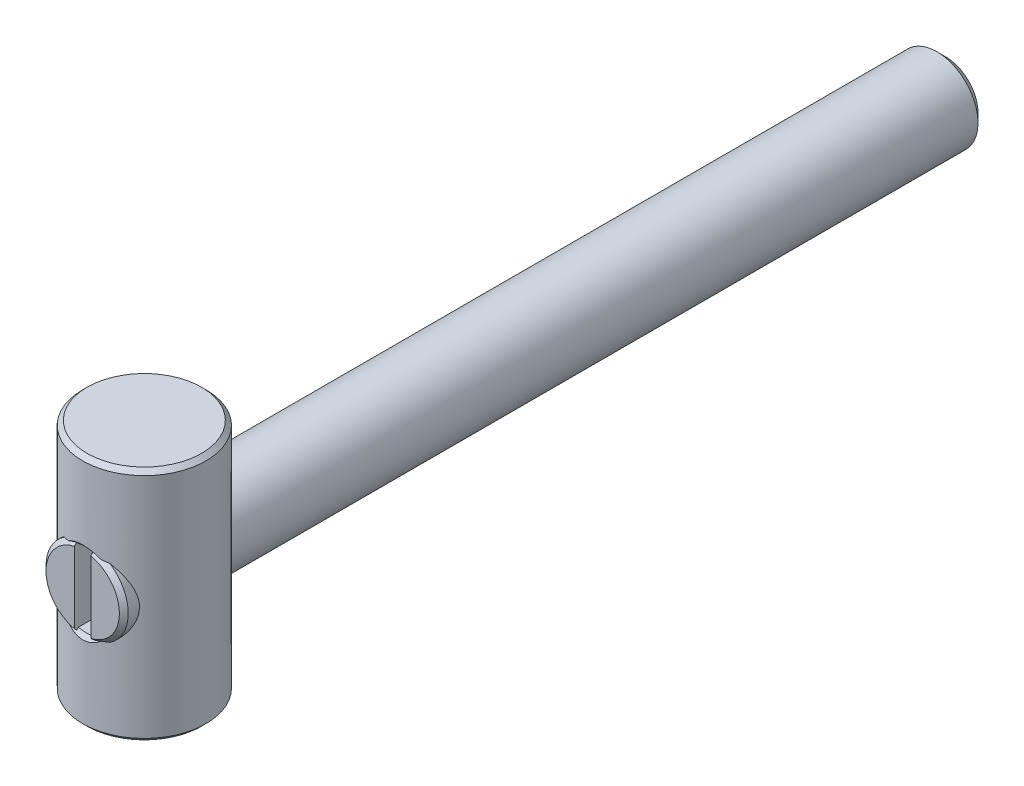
ISO-10303-21;
HEADER;
FILE_DESCRIPTION(('STEP AP214'),'2;1');
FILE_NAME('part.step','',(''),(''),'','','');
FILE_SCHEMA(('AUTOMOTIVE_DESIGN { 1 0 10303 214 1 1 1 1 }'));
ENDSEC;
DATA;
#1=APPLICATION_CONTEXT('core data for automotive mechanical design processes');
#2=APPLICATION_PROTOCOL_DEFINITION('international standard','automotive_design',2000,#1);
#3=PRODUCT_CONTEXT('',#1,'mechanical');
#4=PRODUCT('Part','Part','',(#3));
#5=PRODUCT_RELATED_PRODUCT_CATEGORY('part','',(#4));
#6=PRODUCT_DEFINITION_FORMATION('','',#4);
#7=PRODUCT_DEFINITION_CONTEXT('part definition',#1,'design');
#8=PRODUCT_DEFINITION('design','',#6,#7);
#9=PRODUCT_DEFINITION_SHAPE('','',#8);
#10=(LENGTH_UNIT() NAMED_UNIT(*) SI_UNIT(.MILLI.,.METRE.));
#11=(NAMED_UNIT(*) PLANE_ANGLE_UNIT() SI_UNIT($,.RADIAN.));
#12=(NAMED_UNIT(*) SI_UNIT($,.STERADIAN.) SOLID_ANGLE_UNIT());
#13=UNCERTAINTY_MEASURE_WITH_UNIT(LENGTH_MEASURE(1.E-05),#10,'distance_accuracy_value','');
#14=(GEOMETRIC_REPRESENTATION_CONTEXT(3) GLOBAL_UNCERTAINTY_ASSIGNED_CONTEXT((#13)) GLOBAL_UNIT_ASSIGNED_CONTEXT((#10,
#11,#12)) REPRESENTATION_CONTEXT('',''));
#15=CARTESIAN_POINT('',(0.,0.,0.));
#16=DIRECTION('',(0.,0.,1.));
#17=DIRECTION('',(1.,0.,0.));
#18=AXIS2_PLACEMENT_3D('',#15,#16,#17);
#19=CARTESIAN_POINT('',(0.,0.,-4.));
#20=DIRECTION('',(0.,0.,-1.));
#21=DIRECTION('',(-1.,0.,0.));
#22=AXIS2_PLACEMENT_3D('',#19,#20,#21);
#23=CYLINDRICAL_SURFACE('',#22,2.);
#24=CARTESIAN_POINT('',(1.11399719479,1.6610268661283,2.7855));
#25=CARTESIAN_POINT('',(1.16352046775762,1.62780404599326,2.76569630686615));
#26=CARTESIAN_POINT('',(1.21129322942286,1.59256213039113,2.74505589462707));
#27=CARTESIAN_POINT('',(1.30320814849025,1.51827100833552,2.70263011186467));
#28=CARTESIAN_POINT('',(1.34735150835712,1.47922307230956,2.68084512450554));
#29=CARTESIAN_POINT('',(1.47484746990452,1.35604681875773,2.61420147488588));
#30=CARTESIAN_POINT('',(1.55249324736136,1.26640812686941,2.56837763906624));
#31=CARTESIAN_POINT('',(1.69127884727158,1.07409237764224,2.47919034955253));
#32=CARTESIAN_POINT('',(1.75241552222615,0.971412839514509,2.43582736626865));
#33=CARTESIAN_POINT('',(1.85615019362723,0.754349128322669,2.35773638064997));
#34=CARTESIAN_POINT('',(1.89882852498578,0.640018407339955,2.32297124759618));
#35=CARTESIAN_POINT('',(1.95314493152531,0.438747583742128,2.27729599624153));
#36=CARTESIAN_POINT('',(1.97029467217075,0.354216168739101,2.26233654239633));
#37=CARTESIAN_POINT('',(1.99352675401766,0.182551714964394,2.24189698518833));
#38=CARTESIAN_POINT('',(1.99962325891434,0.0954221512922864,2.23640475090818));
#39=CARTESIAN_POINT('',(2.00034328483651,-0.079061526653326,2.23576112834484));
#40=CARTESIAN_POINT('',(1.99494860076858,-0.166415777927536,2.24062614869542));
#41=CARTESIAN_POINT('',(1.97303463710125,-0.338667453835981,2.25994148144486));
#42=CARTESIAN_POINT('',(1.95650152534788,-0.423561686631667,2.27440371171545));
#43=CARTESIAN_POINT('',(1.90813577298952,-0.608419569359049,2.31521704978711));
#44=CARTESIAN_POINT('',(1.87361856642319,-0.707228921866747,2.34356486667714));
#45=CARTESIAN_POINT('',(1.79082971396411,-0.8964602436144,2.40741595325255));
#46=CARTESIAN_POINT('',(1.7425316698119,-0.986865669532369,2.44293291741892));
#47=CARTESIAN_POINT('',(1.63252243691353,-1.15999565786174,2.51781416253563));
#48=CARTESIAN_POINT('',(1.57057489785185,-1.2425426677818,2.55723849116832));
#49=CARTESIAN_POINT('',(1.43480463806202,-1.39709631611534,2.63580434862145));
#50=CARTESIAN_POINT('',(1.36100810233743,-1.46912554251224,2.67494630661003));
#51=CARTESIAN_POINT('',(1.25497641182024,-1.55764120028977,2.72505273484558));
#52=CARTESIAN_POINT('',(1.22762940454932,-1.57928737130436,2.73749131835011));
#53=CARTESIAN_POINT('',(1.17172197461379,-1.62119899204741,2.76188255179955));
#54=CARTESIAN_POINT('',(1.14316238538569,-1.64146536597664,2.77383552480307));
#55=CARTESIAN_POINT('',(1.11399719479,-1.6610268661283,2.7855));
#56=B_SPLINE_CURVE_WITH_KNOTS('',3,(#24,#25,#26,#27,#28,#29,#30,#31,#32,#33,#34,#35,#36,#37,#38,
#39,#40,#41,#42,#43,#44,#45,#46,#47,#48,#49,#50,#51,#52,#53,#54,#55),.UNSPECIFIED.,.F.,.F.,(4,2,
2,2,2,2,2,2,2,2,2,2,2,2,2,4),(0.,0.188362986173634,0.376663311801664,0.756187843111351,
1.135784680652,1.51371238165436,1.77524600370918,2.03644425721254,2.29805662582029,
2.55999447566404,2.88356492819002,3.20775941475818,3.5380838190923,3.86768804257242,
3.97873730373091,4.08971143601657),.UNSPECIFIED.);
#57=CARTESIAN_POINT('',(1.11399719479,1.6610268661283,2.7855));
#58=VERTEX_POINT('',#57);
#59=CARTESIAN_POINT('',(1.11399719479,-1.6610268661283,2.7855));
#60=VERTEX_POINT('',#59);
#61=EDGE_CURVE('E230',#58,#60,#56,.T.);
#62=ORIENTED_EDGE('',*,*,#61,.F.);
#63=CARTESIAN_POINT('',(0.,0.,2.7855));
#64=DIRECTION('',(0.,0.,-1.));
#65=DIRECTION('',(-1.,0.,0.));
#66=AXIS2_PLACEMENT_3D('',#63,#64,#65);
#67=CIRCLE('',#66,2.);
#68=EDGE_CURVE('E125',#58,#60,#67,.T.);
#69=ORIENTED_EDGE('',*,*,#68,.T.);
#70=EDGE_LOOP('',(#62,#69));
#71=FACE_BOUND('',#70,.T.);
#72=ADVANCED_FACE('F14',(#71),#23,.T.);
#73=CARTESIAN_POINT('',(0.,0.,3.));
#74=DIRECTION('',(0.,0.,-1.));
#75=DIRECTION('',(-1.,0.,0.));
#76=AXIS2_PLACEMENT_3D('',#73,#74,#75);
#77=PLANE('',#76);
#78=DIRECTION('',(0.,-1.,0.));
#79=VECTOR('',#78,1.);
#80=CARTESIAN_POINT('',(-0.4,0.,3.));
#81=LINE('',#80,#79);
#82=CARTESIAN_POINT('',(-0.4,1.74011788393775,3.));
#83=VERTEX_POINT('',#82);
#84=CARTESIAN_POINT('',(-0.4,-1.74011788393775,3.));
#85=VERTEX_POINT('',#84);
#86=EDGE_CURVE('E110',#83,#85,#81,.T.);
#87=ORIENTED_EDGE('',*,*,#86,.F.);
#88=CARTESIAN_POINT('',(0.,0.,3.));
#89=DIRECTION('',(0.,0.,-1.));
#90=DIRECTION('',(-1.,0.,0.));
#91=AXIS2_PLACEMENT_3D('',#88,#89,#90);
#92=CIRCLE('',#91,1.7855);
#93=EDGE_CURVE('E121',#85,#83,#92,.T.);
#94=ORIENTED_EDGE('',*,*,#93,.F.);
#95=EDGE_LOOP('',(#87,#94));
#96=FACE_BOUND('',#95,.T.);
#97=ADVANCED_FACE('F120',(#96),#77,.F.);
#98=CARTESIAN_POINT('',(0.,0.,3.));
#99=DIRECTION('',(0.,0.,-1.));
#100=DIRECTION('',(-1.,0.,0.));
#101=AXIS2_PLACEMENT_3D('',#98,#99,#100);
#102=CONICAL_SURFACE('',#101,1.7855,0.785398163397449);
#103=CARTESIAN_POINT('',(-1.16667612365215,1.65104074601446,2.76385));
#104=CARTESIAN_POINT('',(-1.09329916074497,1.66504476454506,2.79481750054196));
#105=CARTESIAN_POINT('',(-1.01868995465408,1.67914160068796,2.82287437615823));
#106=CARTESIAN_POINT('',(-0.86782079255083,1.70596914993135,2.87283254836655));
#107=CARTESIAN_POINT('',(-0.791576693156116,1.7187090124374,2.89477692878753));
#108=CARTESIAN_POINT('',(-0.637125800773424,1.74152361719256,2.93264181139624));
#109=CARTESIAN_POINT('',(-0.558917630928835,1.75159642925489,2.94855795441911));
#110=CARTESIAN_POINT('',(-0.440293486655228,1.76402293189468,2.96778774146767));
#111=CARTESIAN_POINT('',(-0.400383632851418,1.76772662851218,2.97343575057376));
#112=CARTESIAN_POINT('',(-0.320283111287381,1.77413676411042,2.98312696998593));
#113=CARTESIAN_POINT('',(-0.280092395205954,1.77684302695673,2.98716989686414));
#114=CARTESIAN_POINT('',(-0.2398,1.77901031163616,2.99040063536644));
#115=B_SPLINE_CURVE_WITH_KNOTS('',3,(#103,#104,#105,#106,#107,#108,#109,#110,#111,#112,#113,
#114),.UNSPECIFIED.,.F.,.F.,(4,2,2,2,2,4),(0.,0.242566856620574,0.483378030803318,
0.724363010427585,0.845755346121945,0.967169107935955),.UNSPECIFIED.);
#116=CARTESIAN_POINT('',(-1.11399719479,1.6610268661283,2.7855));
#117=VERTEX_POINT('',#116);
#118=CARTESIAN_POINT('',(-0.794982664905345,1.71770344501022,2.89275));
#119=VERTEX_POINT('',#118);
#120=EDGE_CURVE('E9',#117,#119,#115,.T.);
#121=ORIENTED_EDGE('',*,*,#120,.F.);
#122=CARTESIAN_POINT('',(-1.11399719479,-1.6610268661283,2.7855));
#123=VERTEX_POINT('',#122);
#124=EDGE_CURVE('E130',#123,#117,#67,.T.);
#125=ORIENTED_EDGE('',*,*,#124,.F.);
#126=CARTESIAN_POINT('',(-0.2398,-1.77901031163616,2.99040063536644));
#127=CARTESIAN_POINT('',(-0.280092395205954,-1.77684302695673,2.98716989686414));
#128=CARTESIAN_POINT('',(-0.320283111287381,-1.77413676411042,2.98312696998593));
#129=CARTESIAN_POINT('',(-0.400383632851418,-1.76772662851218,2.97343575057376));
#130=CARTESIAN_POINT('',(-0.440293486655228,-1.76402293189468,2.96778774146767));
#131=CARTESIAN_POINT('',(-0.558917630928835,-1.75159642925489,2.94855795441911));
#132=CARTESIAN_POINT('',(-0.637125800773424,-1.74152361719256,2.93264181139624));
#133=CARTESIAN_POINT('',(-0.791576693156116,-1.7187090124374,2.89477692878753));
#134=CARTESIAN_POINT('',(-0.86782079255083,-1.70596914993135,2.87283254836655));
#135=CARTESIAN_POINT('',(-1.01868995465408,-1.67914160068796,2.82287437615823));
#136=CARTESIAN_POINT('',(-1.09329916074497,-1.66504476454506,2.79481750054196));
#137=CARTESIAN_POINT('',(-1.16667612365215,-1.65104074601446,2.76385));
#138=B_SPLINE_CURVE_WITH_KNOTS('',3,(#126,#127,#128,#129,#130,#131,#132,#133,#134,#135,#136,
#137),.UNSPECIFIED.,.F.,.F.,(4,2,2,2,2,4),(0.,0.12141376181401,0.24280609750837,
0.483791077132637,0.724602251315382,0.967169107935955),.UNSPECIFIED.);
#139=CARTESIAN_POINT('',(-0.794982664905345,-1.71770344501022,2.89275));
#140=VERTEX_POINT('',#139);
#141=EDGE_CURVE('E40',#140,#123,#138,.T.);
#142=ORIENTED_EDGE('',*,*,#141,.F.);
#143=CARTESIAN_POINT('',(0.,0.,2.89275));
#144=DIRECTION('',(0.,0.,1.));
#145=DIRECTION('',(1.,0.,0.));
#146=AXIS2_PLACEMENT_3D('',#143,#144,#145);
#147=CIRCLE('',#146,1.89275);
#148=CARTESIAN_POINT('',(-0.4,-1.85000069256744,2.89275));
#149=VERTEX_POINT('',#148);
#150=EDGE_CURVE('E196',#140,#149,#147,.T.);
#151=ORIENTED_EDGE('',*,*,#150,.T.);
#152=CARTESIAN_POINT('',(-0.4,1.96030622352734,2.7848));
#153=CARTESIAN_POINT('',(-0.4,1.91220040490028,2.83193265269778));
#154=CARTESIAN_POINT('',(-0.4,1.86406179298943,2.87903187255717));
#155=CARTESIAN_POINT('',(-0.4,1.76762008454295,2.97321655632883));
#156=CARTESIAN_POINT('',(-0.4,1.71931684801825,3.02030187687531));
#157=CARTESIAN_POINT('',(-0.4,1.6212885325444,3.11563710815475));
#158=CARTESIAN_POINT('',(-0.4,1.5715604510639,3.16388393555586));
#159=CARTESIAN_POINT('',(-0.4,1.47203148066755,3.26014103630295));
#160=CARTESIAN_POINT('',(-0.4,1.42223083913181,3.30815156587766));
#161=CARTESIAN_POINT('',(-0.4,1.27910635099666,3.44557059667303));
#162=CARTESIAN_POINT('',(-0.4,1.18553880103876,3.53472711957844));
#163=CARTESIAN_POINT('',(-0.4,1.04389226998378,3.66771074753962));
#164=CARTESIAN_POINT('',(-0.4,0.996302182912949,3.71205806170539));
#165=CARTESIAN_POINT('',(-0.4,0.900663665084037,3.80018516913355));
#166=CARTESIAN_POINT('',(-0.4,0.852615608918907,3.84396536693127));
#167=CARTESIAN_POINT('',(-0.4,0.757010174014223,3.9295656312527));
#168=CARTESIAN_POINT('',(-0.4,0.709472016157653,3.97140714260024));
#169=CARTESIAN_POINT('',(-0.4,0.613103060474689,4.05388760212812));
#170=CARTESIAN_POINT('',(-0.4,0.564268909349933,4.0945227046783));
#171=CARTESIAN_POINT('',(-0.4,0.489794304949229,4.15330063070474));
#172=CARTESIAN_POINT('',(-0.4,0.464926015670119,4.17241703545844));
#173=CARTESIAN_POINT('',(-0.4,0.414504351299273,4.2097188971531));
#174=CARTESIAN_POINT('',(-0.4,0.388951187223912,4.22790463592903));
#175=CARTESIAN_POINT('',(-0.4,0.337021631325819,4.26280071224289));
#176=CARTESIAN_POINT('',(-0.4,0.310649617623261,4.27951751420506));
#177=CARTESIAN_POINT('',(-0.4,0.25664656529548,4.31075573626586));
#178=CARTESIAN_POINT('',(-0.4,0.229017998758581,4.32528124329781));
#179=CARTESIAN_POINT('',(-0.4,0.194529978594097,4.34073824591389));
#180=CARTESIAN_POINT('',(-0.4,0.188431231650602,4.34337414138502));
#181=CARTESIAN_POINT('',(-0.4,0.176155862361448,4.34846503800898));
#182=CARTESIAN_POINT('',(-0.4,0.169979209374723,4.35091996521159));
#183=CARTESIAN_POINT('',(-0.4,0.151336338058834,4.35798334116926));
#184=CARTESIAN_POINT('',(-0.4,0.138753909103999,4.36229188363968));
#185=CARTESIAN_POINT('',(-0.4,0.113503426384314,4.36987933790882));
#186=CARTESIAN_POINT('',(-0.4,0.100840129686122,4.37317392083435));
#187=CARTESIAN_POINT('',(-0.4,0.0752707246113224,4.37867100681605));
#188=CARTESIAN_POINT('',(-0.4,0.0623645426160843,4.38087317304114));
#189=CARTESIAN_POINT('',(-0.4,0.0361451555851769,4.38408457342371));
#190=CARTESIAN_POINT('',(-0.4,0.0228289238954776,4.38506967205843));
#191=CARTESIAN_POINT('',(-0.4,-0.00382941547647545,4.38570474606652));
#192=CARTESIAN_POINT('',(-0.4,-0.0171715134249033,4.38535515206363));
#193=CARTESIAN_POINT('',(-0.4,-0.0570913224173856,4.38231129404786));
#194=CARTESIAN_POINT('',(-0.4,-0.0835282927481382,4.37761777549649));
#195=CARTESIAN_POINT('',(-0.4,-0.144402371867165,4.36159805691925));
#196=CARTESIAN_POINT('',(-0.4,-0.178344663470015,4.34850779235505));
#197=CARTESIAN_POINT('',(-0.4,-0.227667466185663,4.32547752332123));
#198=CARTESIAN_POINT('',(-0.4,-0.243900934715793,4.31719757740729));
#199=CARTESIAN_POINT('',(-0.4,-0.275892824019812,4.29976597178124));
#200=CARTESIAN_POINT('',(-0.4,-0.291651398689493,4.29061459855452));
#201=CARTESIAN_POINT('',(-0.4,-0.342427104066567,4.25969743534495));
#202=CARTESIAN_POINT('',(-0.4,-0.376624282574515,4.23660064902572));
#203=CARTESIAN_POINT('',(-0.4,-0.443707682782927,4.18856142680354));
#204=CARTESIAN_POINT('',(-0.4,-0.476592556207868,4.16361716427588));
#205=CARTESIAN_POINT('',(-0.4,-0.541555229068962,4.11253731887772));
#206=CARTESIAN_POINT('',(-0.4,-0.573630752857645,4.08639885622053));
#207=CARTESIAN_POINT('',(-0.4,-0.637167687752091,4.03338342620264));
#208=CARTESIAN_POINT('',(-0.4,-0.668629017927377,4.00650636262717));
#209=CARTESIAN_POINT('',(-0.4,-0.762581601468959,3.92494921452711));
#210=CARTESIAN_POINT('',(-0.4,-0.824422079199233,3.86952173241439));
#211=CARTESIAN_POINT('',(-0.4,-0.947059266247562,3.75773288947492));
#212=CARTESIAN_POINT('',(-0.4,-1.00785750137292,3.70137318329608));
#213=CARTESIAN_POINT('',(-0.4,-1.14419995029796,3.57369126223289));
#214=CARTESIAN_POINT('',(-0.4,-1.21957997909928,3.50219383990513));
#215=CARTESIAN_POINT('',(-0.4,-1.36985690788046,3.35860627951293));
#216=CARTESIAN_POINT('',(-0.4,-1.44475349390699,3.28651581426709));
#217=CARTESIAN_POINT('',(-0.4,-1.59323885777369,3.1429244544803));
#218=CARTESIAN_POINT('',(-0.4,-1.66683198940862,3.07142805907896));
#219=CARTESIAN_POINT('',(-0.4,-1.81374089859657,2.92824339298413));
#220=CARTESIAN_POINT('',(-0.4,-1.88705682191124,2.85655527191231));
#221=CARTESIAN_POINT('',(-0.4,-1.96030622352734,2.7848));
#222=B_SPLINE_CURVE_WITH_KNOTS('',3,(#152,#153,#154,#155,#156,#157,#158,#159,#160,#161,#162,
#163,#164,#165,#166,#167,#168,#169,#170,#171,#172,#173,#174,#175,#176,#177,#178,#179,#180,#181,
#182,#183,#184,#185,#186,#187,#188,#189,#190,#191,#192,#193,#194,#195,#196,#197,#198,#199,#200,
#201,#202,#203,#204,#205,#206,#207,#208,#209,#210,#211,#212,#213,#214,#215,#216,#217,#218,#219,
#220,#221),.UNSPECIFIED.,.F.,.F.,(4,2,2,2,2,2,2,2,2,2,2,2,2,2,2,2,2,2,2,2,2,2,2,2,2,2,2,2,2,2,2,
2,2,2,4),(0.,0.202041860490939,0.404407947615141,0.612267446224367,0.819791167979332,
1.20751042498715,1.40265824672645,1.59765821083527,1.78763722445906,1.97816800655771,
2.07225481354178,2.16631295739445,2.25993394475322,2.35337810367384,2.37330754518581,
2.39324508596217,2.43310931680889,2.47232228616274,2.51154733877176,2.5515383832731,
2.59151652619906,2.67157438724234,2.78007616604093,2.83473709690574,2.88938011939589,
3.0130530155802,3.13684986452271,3.26096287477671,3.38509213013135,3.63419872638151,
3.88290259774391,4.19457948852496,4.50644172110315,4.8142545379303,5.12187303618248),.UNSPECIFIED.);
#223=EDGE_CURVE('E117',#85,#149,#222,.T.);
#224=ORIENTED_EDGE('',*,*,#223,.F.);
#225=ORIENTED_EDGE('',*,*,#93,.T.);
#226=CARTESIAN_POINT('',(-0.4,1.85000069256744,2.89275));
#227=VERTEX_POINT('',#226);
#228=EDGE_CURVE('E106',#227,#83,#222,.T.);
#229=ORIENTED_EDGE('',*,*,#228,.F.);
#230=CARTESIAN_POINT('',(0.,0.,2.89275));
#231=DIRECTION('',(0.,0.,1.));
#232=DIRECTION('',(1.,0.,0.));
#233=AXIS2_PLACEMENT_3D('',#230,#231,#232);
#234=CIRCLE('',#233,1.89275);
#235=EDGE_CURVE('E28',#227,#119,#234,.T.);
#236=ORIENTED_EDGE('',*,*,#235,.T.);
#237=EDGE_LOOP('',(#121,#125,#142,#151,#224,#225,#229,#236));
#238=FACE_BOUND('',#237,.T.);
#239=ADVANCED_FACE('F123',(#238),#102,.T.);
#240=CARTESIAN_POINT('',(0.4,0.,33.));
#241=DIRECTION('',(-1.,0.,0.));
#242=DIRECTION('',(0.,-1.,0.));
#243=AXIS2_PLACEMENT_3D('',#240,#241,#242);
#244=CYLINDRICAL_SURFACE('',#243,31.5);
#245=CARTESIAN_POINT('',(0.4,-1.76576053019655,1.54952957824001));
#246=CARTESIAN_POINT('',(0.349977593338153,-1.77709824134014,1.55016706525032));
#247=CARTESIAN_POINT('',(0.299469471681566,-1.78629930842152,1.55068890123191));
#248=CARTESIAN_POINT('',(0.197847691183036,-1.80038671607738,1.55149171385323));
#249=CARTESIAN_POINT('',(0.146733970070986,-1.8052726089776,1.55177266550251));
#250=CARTESIAN_POINT('',(0.0452193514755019,-1.81063609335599,1.55208115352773));
#251=CARTESIAN_POINT('',(-0.00517737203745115,-1.81119308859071,1.55211325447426));
#252=CARTESIAN_POINT('',(-0.105833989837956,-1.80810483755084,1.55193550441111));
#253=CARTESIAN_POINT('',(-0.156093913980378,-1.8044605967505,1.55172571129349));
#254=CARTESIAN_POINT('',(-0.238696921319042,-1.79499603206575,1.5511843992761));
#255=CARTESIAN_POINT('',(-0.271182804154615,-1.7903758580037,1.55092073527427));
#256=CARTESIAN_POINT('',(-0.335843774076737,-1.77938039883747,1.55029676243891));
#257=CARTESIAN_POINT('',(-0.368018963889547,-1.77300571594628,1.5499364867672));
#258=CARTESIAN_POINT('',(-0.4,-1.76576053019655,1.54952957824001));
#259=B_SPLINE_CURVE_WITH_KNOTS('',3,(#245,#246,#247,#248,#249,#250,#251,#252,#253,#254,#255,
#256,#257,#258),.UNSPECIFIED.,.F.,.F.,(4,2,2,2,2,2,4),(0.,0.153839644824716,0.307695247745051,
0.458721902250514,0.609712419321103,0.708108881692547,0.806471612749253),.UNSPECIFIED.);
#260=CARTESIAN_POINT('',(0.4,-1.76576053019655,1.54952957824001));
#261=VERTEX_POINT('',#260);
#262=CARTESIAN_POINT('',(-0.4,-1.76576053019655,1.54952957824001));
#263=VERTEX_POINT('',#262);
#264=EDGE_CURVE('E345',#261,#263,#259,.T.);
#265=ORIENTED_EDGE('',*,*,#264,.F.);
#266=CARTESIAN_POINT('',(0.4,0.,33.));
#267=DIRECTION('',(1.,0.,0.));
#268=DIRECTION('',(0.,1.,0.));
#269=AXIS2_PLACEMENT_3D('',#266,#267,#268);
#270=CIRCLE('',#269,31.5);
#271=CARTESIAN_POINT('',(0.4,1.76576053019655,1.54952957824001));
#272=VERTEX_POINT('',#271);
#273=EDGE_CURVE('E115',#261,#272,#270,.T.);
#274=ORIENTED_EDGE('',*,*,#273,.T.);
#275=CARTESIAN_POINT('',(-0.4,1.76576053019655,1.54952957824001));
#276=CARTESIAN_POINT('',(-0.349977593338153,1.77709824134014,1.55016706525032));
#277=CARTESIAN_POINT('',(-0.299469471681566,1.78629930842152,1.55068890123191));
#278=CARTESIAN_POINT('',(-0.197847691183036,1.80038671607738,1.55149171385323));
#279=CARTESIAN_POINT('',(-0.146733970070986,1.8052726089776,1.55177266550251));
#280=CARTESIAN_POINT('',(-0.0452193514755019,1.81063609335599,1.55208115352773));
#281=CARTESIAN_POINT('',(0.00517737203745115,1.81119308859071,1.55211325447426));
#282=CARTESIAN_POINT('',(0.105833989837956,1.80810483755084,1.55193550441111));
#283=CARTESIAN_POINT('',(0.156093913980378,1.8044605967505,1.55172571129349));
#284=CARTESIAN_POINT('',(0.238696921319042,1.79499603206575,1.5511843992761));
#285=CARTESIAN_POINT('',(0.271182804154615,1.7903758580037,1.55092073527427));
#286=CARTESIAN_POINT('',(0.335843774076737,1.77938039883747,1.55029676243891));
#287=CARTESIAN_POINT('',(0.368018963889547,1.77300571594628,1.5499364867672));
#288=CARTESIAN_POINT('',(0.4,1.76576053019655,1.54952957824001));
#289=B_SPLINE_CURVE_WITH_KNOTS('',3,(#275,#276,#277,#278,#279,#280,#281,#282,#283,#284,#285,
#286,#287,#288),.UNSPECIFIED.,.F.,.F.,(4,2,2,2,2,2,4),(0.,0.153839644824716,0.307695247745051,
0.458721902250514,0.609712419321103,0.708108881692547,0.806471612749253),.UNSPECIFIED.);
#290=CARTESIAN_POINT('',(-0.4,1.76576053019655,1.54952957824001));
#291=VERTEX_POINT('',#290);
#292=EDGE_CURVE('E194',#291,#272,#289,.T.);
#293=ORIENTED_EDGE('',*,*,#292,.F.);
#294=CARTESIAN_POINT('',(-0.4,0.,33.));
#295=DIRECTION('',(1.,0.,0.));
#296=DIRECTION('',(0.,1.,0.));
#297=AXIS2_PLACEMENT_3D('',#294,#295,#296);
#298=CIRCLE('',#297,31.5);
#299=EDGE_CURVE('E291',#263,#291,#298,.T.);
#300=ORIENTED_EDGE('',*,*,#299,.F.);
#301=EDGE_LOOP('',(#265,#274,#293,#300));
#302=FACE_BOUND('',#301,.T.);
#303=ADVANCED_FACE('F279',(#302),#244,.F.);
#304=CARTESIAN_POINT('',(-0.4,0.,33.));
#305=DIRECTION('',(1.,0.,0.));
#306=DIRECTION('',(0.,1.,0.));
#307=AXIS2_PLACEMENT_3D('',#304,#305,#306);
#308=PLANE('',#307);
#309=CARTESIAN_POINT('',(-0.4,-1.02034635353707,2.09595012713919));
#310=CARTESIAN_POINT('',(-0.4,-1.05950736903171,2.13241722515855));
#311=CARTESIAN_POINT('',(-0.4,-1.09853653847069,2.16902508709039));
#312=CARTESIAN_POINT('',(-0.4,-1.17638543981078,2.24246200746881));
#313=CARTESIAN_POINT('',(-0.4,-1.21520517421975,2.2792910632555));
#314=CARTESIAN_POINT('',(-0.4,-1.33143077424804,2.39001871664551));
#315=CARTESIAN_POINT('',(-0.4,-1.40860528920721,2.46415991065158));
#316=CARTESIAN_POINT('',(-0.4,-1.56257008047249,2.6128326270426));
#317=CARTESIAN_POINT('',(-0.4,-1.6393603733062,2.6873641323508));
#318=CARTESIAN_POINT('',(-0.4,-1.79268710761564,2.83668891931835));
#319=CARTESIAN_POINT('',(-0.4,-1.86922354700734,2.91148220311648));
#320=CARTESIAN_POINT('',(-0.4,-2.0533689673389,3.0918524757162));
#321=CARTESIAN_POINT('',(-0.4,-2.16089223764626,3.19751690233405));
#322=CARTESIAN_POINT('',(-0.4,-2.37571065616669,3.40908334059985));
#323=CARTESIAN_POINT('',(-0.4,-2.48300579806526,3.51498535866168));
#324=CARTESIAN_POINT('',(-0.4,-2.59024265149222,3.62094582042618));
#325=B_SPLINE_CURVE_WITH_KNOTS('',3,(#309,#310,#311,#312,#313,#314,#315,#316,#317,#318,#319,
#320,#321,#322,#323,#324),.UNSPECIFIED.,.F.,.F.,(4,2,2,2,2,2,2,4),(0.,0.160532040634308,
0.321062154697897,0.64211312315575,0.963150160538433,1.2841898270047,1.73644596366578,
2.18871445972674),.UNSPECIFIED.);
#326=CARTESIAN_POINT('',(-0.4,-1.76576053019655,2.8105));
#327=VERTEX_POINT('',#326);
#328=EDGE_CURVE('E180',#327,#149,#325,.T.);
#329=ORIENTED_EDGE('',*,*,#328,.F.);
#330=DIRECTION('',(0.,0.,-1.));
#331=VECTOR('',#330,1.);
#332=CARTESIAN_POINT('',(-0.4,-1.76576053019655,-3.));
#333=LINE('',#332,#331);
#334=EDGE_CURVE('E142',#263,#327,#333,.F.);
#335=ORIENTED_EDGE('',*,*,#334,.F.);
#336=ORIENTED_EDGE('',*,*,#299,.T.);
#337=DIRECTION('',(0.,0.,-1.));
#338=VECTOR('',#337,1.);
#339=CARTESIAN_POINT('',(-0.4,1.76576053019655,-3.));
#340=LINE('',#339,#338);
#341=CARTESIAN_POINT('',(-0.4,1.76576053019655,2.8105));
#342=VERTEX_POINT('',#341);
#343=EDGE_CURVE('E128',#342,#291,#340,.T.);
#344=ORIENTED_EDGE('',*,*,#343,.F.);
#345=CARTESIAN_POINT('',(-0.4,2.59024265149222,3.62094582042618));
#346=CARTESIAN_POINT('',(-0.4,2.46048935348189,3.49276389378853));
#347=CARTESIAN_POINT('',(-0.4,2.33066988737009,3.3646473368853));
#348=CARTESIAN_POINT('',(-0.4,2.0706621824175,3.10879920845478));
#349=CARTESIAN_POINT('',(-0.4,1.9404739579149,2.98106762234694));
#350=CARTESIAN_POINT('',(-0.4,1.74472718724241,2.78993924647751));
#351=CARTESIAN_POINT('',(-0.4,1.67939930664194,2.72630645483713));
#352=CARTESIAN_POINT('',(-0.4,1.5485207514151,2.59927137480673));
#353=CARTESIAN_POINT('',(-0.4,1.48297007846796,2.5358690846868));
#354=CARTESIAN_POINT('',(-0.4,1.35155357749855,2.40938546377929));
#355=CARTESIAN_POINT('',(-0.4,1.285687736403,2.34630414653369));
#356=CARTESIAN_POINT('',(-0.4,1.15344707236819,2.22067435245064));
#357=CARTESIAN_POINT('',(-0.4,1.08707223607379,2.15812588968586));
#358=CARTESIAN_POINT('',(-0.4,1.02034635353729,2.09595012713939));
#359=B_SPLINE_CURVE_WITH_KNOTS('',3,(#345,#346,#347,#348,#349,#350,#351,#352,#353,#354,#355,
#356,#357,#358),.UNSPECIFIED.,.F.,.F.,(4,2,2,2,2,2,4),(0.,0.54717523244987,1.09432947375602,
1.36791954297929,1.6415075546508,1.91510701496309,2.18871367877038),.UNSPECIFIED.);
#360=EDGE_CURVE('E113',#227,#342,#359,.T.);
#361=ORIENTED_EDGE('',*,*,#360,.F.);
#362=ORIENTED_EDGE('',*,*,#228,.T.);
#363=ORIENTED_EDGE('',*,*,#86,.T.);
#364=ORIENTED_EDGE('',*,*,#223,.T.);
#365=EDGE_LOOP('',(#329,#335,#336,#344,#361,#362,#363,#364));
#366=FACE_BOUND('',#365,.T.);
#367=ADVANCED_FACE('F108',(#366),#308,.T.);
#368=CARTESIAN_POINT('',(0.4,1.74011788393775,3.));
#369=VERTEX_POINT('',#368);
#370=CARTESIAN_POINT('',(0.4,-1.74011788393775,3.));
#371=VERTEX_POINT('',#370);
#372=EDGE_CURVE('E124',#369,#371,#92,.T.);
#373=ORIENTED_EDGE('',*,*,#372,.F.);
#374=DIRECTION('',(0.,-1.,0.));
#375=VECTOR('',#374,1.);
#376=CARTESIAN_POINT('',(0.4,0.,3.));
#377=LINE('',#376,#375);
#378=EDGE_CURVE('E335',#369,#371,#377,.T.);
#379=ORIENTED_EDGE('',*,*,#378,.T.);
#380=EDGE_LOOP('',(#373,#379));
#381=FACE_BOUND('',#380,.T.);
#382=ADVANCED_FACE('F280',(#381),#77,.F.);
#383=CARTESIAN_POINT('',(0.2398,1.77901031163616,2.99040063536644));
#384=CARTESIAN_POINT('',(0.280092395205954,1.77684302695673,2.98716989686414));
#385=CARTESIAN_POINT('',(0.320283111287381,1.77413676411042,2.98312696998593));
#386=CARTESIAN_POINT('',(0.400383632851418,1.76772662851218,2.97343575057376));
#387=CARTESIAN_POINT('',(0.440293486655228,1.76402293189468,2.96778774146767));
#388=CARTESIAN_POINT('',(0.558917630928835,1.75159642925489,2.94855795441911));
#389=CARTESIAN_POINT('',(0.637125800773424,1.74152361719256,2.93264181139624));
#390=CARTESIAN_POINT('',(0.791576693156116,1.7187090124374,2.89477692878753));
#391=CARTESIAN_POINT('',(0.86782079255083,1.70596914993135,2.87283254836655));
#392=CARTESIAN_POINT('',(1.01868995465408,1.67914160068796,2.82287437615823));
#393=CARTESIAN_POINT('',(1.09329916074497,1.66504476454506,2.79481750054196));
#394=CARTESIAN_POINT('',(1.16667612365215,1.65104074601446,2.76385));
#395=B_SPLINE_CURVE_WITH_KNOTS('',3,(#383,#384,#385,#386,#387,#388,#389,#390,#391,#392,#393,
#394),.UNSPECIFIED.,.F.,.F.,(4,2,2,2,2,4),(0.,0.12141376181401,0.24280609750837,
0.483791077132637,0.724602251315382,0.967169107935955),.UNSPECIFIED.);
#396=CARTESIAN_POINT('',(0.794982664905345,1.71770344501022,2.89275));
#397=VERTEX_POINT('',#396);
#398=EDGE_CURVE('E228',#397,#58,#395,.T.);
#399=ORIENTED_EDGE('',*,*,#398,.F.);
#400=CARTESIAN_POINT('',(0.,0.,2.89275));
#401=DIRECTION('',(0.,0.,1.));
#402=DIRECTION('',(1.,0.,0.));
#403=AXIS2_PLACEMENT_3D('',#400,#401,#402);
#404=CIRCLE('',#403,1.89275);
#405=CARTESIAN_POINT('',(0.4,1.85000069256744,2.89275));
#406=VERTEX_POINT('',#405);
#407=EDGE_CURVE('E225',#397,#406,#404,.T.);
#408=ORIENTED_EDGE('',*,*,#407,.T.);
#409=CARTESIAN_POINT('',(0.4,1.96030622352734,2.7848));
#410=CARTESIAN_POINT('',(0.4,1.91220040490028,2.83193265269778));
#411=CARTESIAN_POINT('',(0.4,1.86406179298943,2.87903187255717));
#412=CARTESIAN_POINT('',(0.4,1.76762008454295,2.97321655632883));
#413=CARTESIAN_POINT('',(0.4,1.71931684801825,3.02030187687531));
#414=CARTESIAN_POINT('',(0.4,1.6212885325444,3.11563710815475));
#415=CARTESIAN_POINT('',(0.4,1.5715604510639,3.16388393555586));
#416=CARTESIAN_POINT('',(0.4,1.47203148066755,3.26014103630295));
#417=CARTESIAN_POINT('',(0.4,1.42223083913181,3.30815156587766));
#418=CARTESIAN_POINT('',(0.4,1.27910635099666,3.44557059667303));
#419=CARTESIAN_POINT('',(0.4,1.18553880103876,3.53472711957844));
#420=CARTESIAN_POINT('',(0.4,1.04389226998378,3.66771074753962));
#421=CARTESIAN_POINT('',(0.4,0.996302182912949,3.71205806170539));
#422=CARTESIAN_POINT('',(0.4,0.900663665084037,3.80018516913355));
#423=CARTESIAN_POINT('',(0.4,0.852615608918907,3.84396536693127));
#424=CARTESIAN_POINT('',(0.4,0.757010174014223,3.9295656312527));
#425=CARTESIAN_POINT('',(0.4,0.709472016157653,3.97140714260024));
#426=CARTESIAN_POINT('',(0.4,0.613103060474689,4.05388760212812));
#427=CARTESIAN_POINT('',(0.4,0.564268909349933,4.0945227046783));
#428=CARTESIAN_POINT('',(0.4,0.489794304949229,4.15330063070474));
#429=CARTESIAN_POINT('',(0.4,0.464926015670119,4.17241703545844));
#430=CARTESIAN_POINT('',(0.4,0.414504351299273,4.2097188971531));
#431=CARTESIAN_POINT('',(0.4,0.388951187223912,4.22790463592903));
#432=CARTESIAN_POINT('',(0.4,0.337021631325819,4.26280071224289));
#433=CARTESIAN_POINT('',(0.4,0.310649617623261,4.27951751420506));
#434=CARTESIAN_POINT('',(0.4,0.25664656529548,4.31075573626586));
#435=CARTESIAN_POINT('',(0.4,0.229017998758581,4.32528124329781));
#436=CARTESIAN_POINT('',(0.4,0.194529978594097,4.34073824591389));
#437=CARTESIAN_POINT('',(0.4,0.188431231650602,4.34337414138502));
#438=CARTESIAN_POINT('',(0.4,0.176155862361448,4.34846503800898));
#439=CARTESIAN_POINT('',(0.4,0.169979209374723,4.35091996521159));
#440=CARTESIAN_POINT('',(0.4,0.151336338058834,4.35798334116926));
#441=CARTESIAN_POINT('',(0.4,0.138753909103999,4.36229188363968));
#442=CARTESIAN_POINT('',(0.4,0.113503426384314,4.36987933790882));
#443=CARTESIAN_POINT('',(0.4,0.100840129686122,4.37317392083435));
#444=CARTESIAN_POINT('',(0.4,0.0752707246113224,4.37867100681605));
#445=CARTESIAN_POINT('',(0.4,0.0623645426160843,4.38087317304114));
#446=CARTESIAN_POINT('',(0.4,0.0361451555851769,4.38408457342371));
#447=CARTESIAN_POINT('',(0.4,0.0228289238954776,4.38506967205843));
#448=CARTESIAN_POINT('',(0.4,-0.00382941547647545,4.38570474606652));
#449=CARTESIAN_POINT('',(0.4,-0.0171715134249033,4.38535515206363));
#450=CARTESIAN_POINT('',(0.4,-0.0570913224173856,4.38231129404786));
#451=CARTESIAN_POINT('',(0.4,-0.0835282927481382,4.37761777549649));
#452=CARTESIAN_POINT('',(0.4,-0.144402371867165,4.36159805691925));
#453=CARTESIAN_POINT('',(0.4,-0.178344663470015,4.34850779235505));
#454=CARTESIAN_POINT('',(0.4,-0.227667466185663,4.32547752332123));
#455=CARTESIAN_POINT('',(0.4,-0.243900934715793,4.31719757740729));
#456=CARTESIAN_POINT('',(0.4,-0.275892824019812,4.29976597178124));
#457=CARTESIAN_POINT('',(0.4,-0.291651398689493,4.29061459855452));
#458=CARTESIAN_POINT('',(0.4,-0.342427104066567,4.25969743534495));
#459=CARTESIAN_POINT('',(0.4,-0.376624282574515,4.23660064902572));
#460=CARTESIAN_POINT('',(0.4,-0.443707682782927,4.18856142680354));
#461=CARTESIAN_POINT('',(0.4,-0.476592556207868,4.16361716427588));
#462=CARTESIAN_POINT('',(0.4,-0.541555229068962,4.11253731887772));
#463=CARTESIAN_POINT('',(0.4,-0.573630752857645,4.08639885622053));
#464=CARTESIAN_POINT('',(0.4,-0.637167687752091,4.03338342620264));
#465=CARTESIAN_POINT('',(0.4,-0.668629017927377,4.00650636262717));
#466=CARTESIAN_POINT('',(0.4,-0.762581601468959,3.92494921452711));
#467=CARTESIAN_POINT('',(0.4,-0.824422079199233,3.86952173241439));
#468=CARTESIAN_POINT('',(0.4,-0.947059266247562,3.75773288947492));
#469=CARTESIAN_POINT('',(0.4,-1.00785750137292,3.70137318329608));
#470=CARTESIAN_POINT('',(0.4,-1.14419995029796,3.57369126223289));
#471=CARTESIAN_POINT('',(0.4,-1.21957997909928,3.50219383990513));
#472=CARTESIAN_POINT('',(0.4,-1.36985690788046,3.35860627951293));
#473=CARTESIAN_POINT('',(0.4,-1.44475349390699,3.28651581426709));
#474=CARTESIAN_POINT('',(0.4,-1.59323885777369,3.1429244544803));
#475=CARTESIAN_POINT('',(0.4,-1.66683198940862,3.07142805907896));
#476=CARTESIAN_POINT('',(0.4,-1.81374089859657,2.92824339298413));
#477=CARTESIAN_POINT('',(0.4,-1.88705682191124,2.85655527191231));
#478=CARTESIAN_POINT('',(0.4,-1.96030622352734,2.7848));
#479=B_SPLINE_CURVE_WITH_KNOTS('',3,(#409,#410,#411,#412,#413,#414,#415,#416,#417,#418,#419,
#420,#421,#422,#423,#424,#425,#426,#427,#428,#429,#430,#431,#432,#433,#434,#435,#436,#437,#438,
#439,#440,#441,#442,#443,#444,#445,#446,#447,#448,#449,#450,#451,#452,#453,#454,#455,#456,#457,
#458,#459,#460,#461,#462,#463,#464,#465,#466,#467,#468,#469,#470,#471,#472,#473,#474,#475,#476,
#477,#478),.UNSPECIFIED.,.F.,.F.,(4,2,2,2,2,2,2,2,2,2,2,2,2,2,2,2,2,2,2,2,2,2,2,2,2,2,2,2,2,2,2,
2,2,2,4),(0.,0.202041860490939,0.404407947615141,0.612267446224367,0.819791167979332,
1.20751042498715,1.40265824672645,1.59765821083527,1.78763722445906,1.97816800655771,
2.07225481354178,2.16631295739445,2.25993394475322,2.35337810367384,2.37330754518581,
2.39324508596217,2.43310931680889,2.47232228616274,2.51154733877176,2.5515383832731,
2.59151652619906,2.67157438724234,2.78007616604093,2.83473709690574,2.88938011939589,
3.0130530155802,3.13684986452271,3.26096287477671,3.38509213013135,3.63419872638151,
3.88290259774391,4.19457948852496,4.50644172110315,4.8142545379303,5.12187303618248),.UNSPECIFIED.);
#480=EDGE_CURVE('E212',#406,#369,#479,.T.);
#481=ORIENTED_EDGE('',*,*,#480,.T.);
#482=ORIENTED_EDGE('',*,*,#372,.T.);
#483=CARTESIAN_POINT('',(0.4,-1.85000069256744,2.89275));
#484=VERTEX_POINT('',#483);
#485=EDGE_CURVE('E333',#371,#484,#479,.T.);
#486=ORIENTED_EDGE('',*,*,#485,.T.);
#487=CARTESIAN_POINT('',(0.,0.,2.89275));
#488=DIRECTION('',(0.,0.,1.));
#489=DIRECTION('',(1.,0.,0.));
#490=AXIS2_PLACEMENT_3D('',#487,#488,#489);
#491=CIRCLE('',#490,1.89275);
#492=CARTESIAN_POINT('',(0.794982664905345,-1.71770344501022,2.89275));
#493=VERTEX_POINT('',#492);
#494=EDGE_CURVE('E198',#484,#493,#491,.T.);
#495=ORIENTED_EDGE('',*,*,#494,.T.);
#496=CARTESIAN_POINT('',(1.16667612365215,-1.65104074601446,2.76385));
#497=CARTESIAN_POINT('',(1.09329916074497,-1.66504476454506,2.79481750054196));
#498=CARTESIAN_POINT('',(1.01868995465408,-1.67914160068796,2.82287437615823));
#499=CARTESIAN_POINT('',(0.86782079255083,-1.70596914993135,2.87283254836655));
#500=CARTESIAN_POINT('',(0.791576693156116,-1.7187090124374,2.89477692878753));
#501=CARTESIAN_POINT('',(0.637125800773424,-1.74152361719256,2.93264181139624));
#502=CARTESIAN_POINT('',(0.558917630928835,-1.75159642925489,2.94855795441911));
#503=CARTESIAN_POINT('',(0.440293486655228,-1.76402293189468,2.96778774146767));
#504=CARTESIAN_POINT('',(0.400383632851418,-1.76772662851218,2.97343575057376));
#505=CARTESIAN_POINT('',(0.320283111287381,-1.77413676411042,2.98312696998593));
#506=CARTESIAN_POINT('',(0.280092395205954,-1.77684302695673,2.98716989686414));
#507=CARTESIAN_POINT('',(0.2398,-1.77901031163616,2.99040063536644));
#508=B_SPLINE_CURVE_WITH_KNOTS('',3,(#496,#497,#498,#499,#500,#501,#502,#503,#504,#505,#506,
#507),.UNSPECIFIED.,.F.,.F.,(4,2,2,2,2,4),(0.,0.242566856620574,0.483378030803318,
0.724363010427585,0.845755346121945,0.967169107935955),.UNSPECIFIED.);
#509=EDGE_CURVE('E229',#60,#493,#508,.T.);
#510=ORIENTED_EDGE('',*,*,#509,.F.);
#511=ORIENTED_EDGE('',*,*,#68,.F.);
#512=EDGE_LOOP('',(#399,#408,#481,#482,#486,#495,#510,#511));
#513=FACE_BOUND('',#512,.T.);
#514=ADVANCED_FACE('F205',(#513),#102,.T.);
#515=CARTESIAN_POINT('',(0.4,0.,33.));
#516=DIRECTION('',(1.,0.,0.));
#517=DIRECTION('',(0.,1.,0.));
#518=AXIS2_PLACEMENT_3D('',#515,#516,#517);
#519=PLANE('',#518);
#520=DIRECTION('',(0.,0.,-1.));
#521=VECTOR('',#520,1.);
#522=CARTESIAN_POINT('',(0.4,-1.76576053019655,-3.));
#523=LINE('',#522,#521);
#524=CARTESIAN_POINT('',(0.4,-1.76576053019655,2.8105));
#525=VERTEX_POINT('',#524);
#526=EDGE_CURVE('E195',#261,#525,#523,.F.);
#527=ORIENTED_EDGE('',*,*,#526,.T.);
#528=CARTESIAN_POINT('',(0.4,-1.02034635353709,2.0959501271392));
#529=CARTESIAN_POINT('',(0.4,-1.05950736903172,2.13241722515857));
#530=CARTESIAN_POINT('',(0.4,-1.09853653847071,2.16902508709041));
#531=CARTESIAN_POINT('',(0.4,-1.1763854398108,2.24246200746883));
#532=CARTESIAN_POINT('',(0.4,-1.21520517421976,2.27929106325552));
#533=CARTESIAN_POINT('',(0.4,-1.33143077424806,2.39001871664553));
#534=CARTESIAN_POINT('',(0.4,-1.40860528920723,2.4641599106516));
#535=CARTESIAN_POINT('',(0.4,-1.56257008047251,2.61283262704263));
#536=CARTESIAN_POINT('',(0.4,-1.63936037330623,2.68736413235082));
#537=CARTESIAN_POINT('',(0.4,-1.79268710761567,2.83668891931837));
#538=CARTESIAN_POINT('',(0.4,-1.86922354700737,2.9114822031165));
#539=CARTESIAN_POINT('',(0.4,-2.05336896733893,3.09185247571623));
#540=CARTESIAN_POINT('',(0.4,-2.16089223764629,3.19751690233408));
#541=CARTESIAN_POINT('',(0.4,-2.3757106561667,3.40908334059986));
#542=CARTESIAN_POINT('',(0.4,-2.48300579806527,3.51498535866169));
#543=CARTESIAN_POINT('',(0.4,-2.59024265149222,3.62094582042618));
#544=B_SPLINE_CURVE_WITH_KNOTS('',3,(#528,#529,#530,#531,#532,#533,#534,#535,#536,#537,#538,
#539,#540,#541,#542,#543),.UNSPECIFIED.,.F.,.F.,(4,2,2,2,2,2,2,4),(0.,0.16053204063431,
0.321062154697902,0.64211312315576,0.963150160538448,1.28418982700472,1.73644596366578,
2.18871445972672),.UNSPECIFIED.);
#545=EDGE_CURVE('E187',#525,#484,#544,.T.);
#546=ORIENTED_EDGE('',*,*,#545,.T.);
#547=ORIENTED_EDGE('',*,*,#485,.F.);
#548=ORIENTED_EDGE('',*,*,#378,.F.);
#549=ORIENTED_EDGE('',*,*,#480,.F.);
#550=CARTESIAN_POINT('',(0.4,2.59024265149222,3.62094582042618));
#551=CARTESIAN_POINT('',(0.4,2.46048935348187,3.49276389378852));
#552=CARTESIAN_POINT('',(0.4,2.33066988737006,3.36464733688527));
#553=CARTESIAN_POINT('',(0.4,2.07066218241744,3.10879920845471));
#554=CARTESIAN_POINT('',(0.4,1.94047395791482,2.98106762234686));
#555=CARTESIAN_POINT('',(0.4,1.7447271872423,2.7899392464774));
#556=CARTESIAN_POINT('',(0.4,1.67939930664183,2.72630645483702));
#557=CARTESIAN_POINT('',(0.4,1.54852075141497,2.5992713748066));
#558=CARTESIAN_POINT('',(0.4,1.48297007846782,2.53586908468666));
#559=CARTESIAN_POINT('',(0.4,1.35155357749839,2.40938546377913));
#560=CARTESIAN_POINT('',(0.4,1.28568773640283,2.34630414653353));
#561=CARTESIAN_POINT('',(0.4,1.153447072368,2.22067435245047));
#562=CARTESIAN_POINT('',(0.4,1.0870722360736,2.15812588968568));
#563=CARTESIAN_POINT('',(0.4,1.02034635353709,2.0959501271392));
#564=B_SPLINE_CURVE_WITH_KNOTS('',3,(#550,#551,#552,#553,#554,#555,#556,#557,#558,#559,#560,
#561,#562,#563),.UNSPECIFIED.,.F.,.F.,(4,2,2,2,2,2,4),(0.,0.54717523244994,1.09432947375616,
1.36791954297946,1.64150755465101,1.91510701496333,2.18871367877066),.UNSPECIFIED.);
#565=CARTESIAN_POINT('',(0.4,1.76576053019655,2.8105));
#566=VERTEX_POINT('',#565);
#567=EDGE_CURVE('E217',#406,#566,#564,.T.);
#568=ORIENTED_EDGE('',*,*,#567,.T.);
#569=DIRECTION('',(0.,0.,-1.));
#570=VECTOR('',#569,1.);
#571=CARTESIAN_POINT('',(0.4,1.76576053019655,-3.));
#572=LINE('',#571,#570);
#573=EDGE_CURVE('E224',#566,#272,#572,.T.);
#574=ORIENTED_EDGE('',*,*,#573,.T.);
#575=ORIENTED_EDGE('',*,*,#273,.F.);
#576=EDGE_LOOP('',(#527,#546,#547,#548,#549,#568,#574,#575));
#577=FACE_BOUND('',#576,.T.);
#578=ADVANCED_FACE('F200',(#577),#519,.F.);
#579=CARTESIAN_POINT('',(-1.11399719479,-1.6610268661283,2.7855));
#580=CARTESIAN_POINT('',(-1.16352046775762,-1.62780404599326,2.76569630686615));
#581=CARTESIAN_POINT('',(-1.21129322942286,-1.59256213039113,2.74505589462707));
#582=CARTESIAN_POINT('',(-1.30320814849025,-1.51827100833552,2.70263011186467));
#583=CARTESIAN_POINT('',(-1.34735150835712,-1.47922307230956,2.68084512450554));
#584=CARTESIAN_POINT('',(-1.47484746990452,-1.35604681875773,2.61420147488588));
#585=CARTESIAN_POINT('',(-1.55249324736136,-1.26640812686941,2.56837763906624));
#586=CARTESIAN_POINT('',(-1.69127884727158,-1.07409237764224,2.47919034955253));
#587=CARTESIAN_POINT('',(-1.75241552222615,-0.971412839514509,2.43582736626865));
#588=CARTESIAN_POINT('',(-1.85615019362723,-0.754349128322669,2.35773638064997));
#589=CARTESIAN_POINT('',(-1.89882852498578,-0.640018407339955,2.32297124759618));
#590=CARTESIAN_POINT('',(-1.95314493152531,-0.438747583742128,2.27729599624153));
#591=CARTESIAN_POINT('',(-1.97029467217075,-0.354216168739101,2.26233654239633));
#592=CARTESIAN_POINT('',(-1.99352675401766,-0.182551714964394,2.24189698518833));
#593=CARTESIAN_POINT('',(-1.99962325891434,-0.0954221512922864,2.23640475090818));
#594=CARTESIAN_POINT('',(-2.00034328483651,0.079061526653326,2.23576112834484));
#595=CARTESIAN_POINT('',(-1.99494860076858,0.166415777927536,2.24062614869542));
#596=CARTESIAN_POINT('',(-1.97303463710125,0.338667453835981,2.25994148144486));
#597=CARTESIAN_POINT('',(-1.95650152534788,0.423561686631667,2.27440371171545));
#598=CARTESIAN_POINT('',(-1.90813577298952,0.608419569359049,2.31521704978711));
#599=CARTESIAN_POINT('',(-1.87361856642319,0.707228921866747,2.34356486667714));
#600=CARTESIAN_POINT('',(-1.79082971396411,0.8964602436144,2.40741595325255));
#601=CARTESIAN_POINT('',(-1.7425316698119,0.986865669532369,2.44293291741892));
#602=CARTESIAN_POINT('',(-1.63252243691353,1.15999565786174,2.51781416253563));
#603=CARTESIAN_POINT('',(-1.57057489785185,1.2425426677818,2.55723849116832));
#604=CARTESIAN_POINT('',(-1.43480463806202,1.39709631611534,2.63580434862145));
#605=CARTESIAN_POINT('',(-1.36100810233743,1.46912554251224,2.67494630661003));
#606=CARTESIAN_POINT('',(-1.25497641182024,1.55764120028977,2.72505273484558));
#607=CARTESIAN_POINT('',(-1.22762940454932,1.57928737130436,2.73749131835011));
#608=CARTESIAN_POINT('',(-1.17172197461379,1.62119899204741,2.76188255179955));
#609=CARTESIAN_POINT('',(-1.14316238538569,1.64146536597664,2.77383552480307));
#610=CARTESIAN_POINT('',(-1.11399719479,1.6610268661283,2.7855));
#611=B_SPLINE_CURVE_WITH_KNOTS('',3,(#579,#580,#581,#582,#583,#584,#585,#586,#587,#588,#589,
#590,#591,#592,#593,#594,#595,#596,#597,#598,#599,#600,#601,#602,#603,#604,#605,#606,#607,#608,
#609,#610),.UNSPECIFIED.,.F.,.F.,(4,2,2,2,2,2,2,2,2,2,2,2,2,2,2,4),(0.,0.188362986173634,
0.376663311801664,0.756187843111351,1.135784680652,1.51371238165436,1.77524600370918,
2.03644425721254,2.29805662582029,2.55999447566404,2.88356492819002,3.20775941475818,
3.5380838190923,3.86768804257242,3.97873730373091,4.08971143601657),.UNSPECIFIED.);
#612=EDGE_CURVE('E237',#123,#117,#611,.T.);
#613=ORIENTED_EDGE('',*,*,#612,.F.);
#614=ORIENTED_EDGE('',*,*,#124,.T.);
#615=EDGE_LOOP('',(#613,#614));
#616=FACE_BOUND('',#615,.T.);
#617=ADVANCED_FACE('F204',(#616),#23,.T.);
#618=CARTESIAN_POINT('',(-2.,0.,-2.23606797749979));
#619=CARTESIAN_POINT('',(-1.99999453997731,-0.0976283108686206,-2.23607753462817));
#620=CARTESIAN_POINT('',(-1.99278992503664,-0.195290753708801,-2.24258071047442));
#621=CARTESIAN_POINT('',(-1.96458268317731,-0.387119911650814,-2.26731972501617));
#622=CARTESIAN_POINT('',(-1.94355530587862,-0.481280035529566,-2.2855766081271));
#623=CARTESIAN_POINT('',(-1.88935861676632,-0.662735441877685,-2.3305658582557));
#624=CARTESIAN_POINT('',(-1.85630718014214,-0.750087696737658,-2.35721561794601));
#625=CARTESIAN_POINT('',(-1.77934008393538,-0.917865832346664,-2.41584094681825));
#626=CARTESIAN_POINT('',(-1.73542216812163,-0.998290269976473,-2.44781762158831));
#627=CARTESIAN_POINT('',(-1.63002410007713,-1.16364688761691,-2.51946072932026));
#628=CARTESIAN_POINT('',(-1.56687435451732,-1.2473321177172,-2.55954936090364));
#629=CARTESIAN_POINT('',(-1.4281921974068,-1.40400270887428,-2.63944827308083));
#630=CARTESIAN_POINT('',(-1.3526477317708,-1.47697752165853,-2.67925824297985));
#631=CARTESIAN_POINT('',(-1.17815690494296,-1.62064365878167,-2.76088818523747));
#632=CARTESIAN_POINT('',(-1.07740643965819,-1.68948251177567,-2.80216785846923));
#633=CARTESIAN_POINT('',(-0.862470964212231,-1.80864209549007,-2.87558484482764));
#634=CARTESIAN_POINT('',(-0.748301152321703,-1.85898351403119,-2.90773236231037));
#635=CARTESIAN_POINT('',(-0.523249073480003,-1.93355640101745,-2.95599907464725));
#636=CARTESIAN_POINT('',(-0.413434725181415,-1.96008334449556,-2.97351175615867));
#637=CARTESIAN_POINT('',(-0.189695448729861,-1.99418448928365,-2.99609745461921));
#638=CARTESIAN_POINT('',(-0.0757758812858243,-2.00178255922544,-3.00118613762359));
#639=CARTESIAN_POINT('',(0.13414705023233,-1.99782755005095,-2.99855361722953));
#640=CARTESIAN_POINT('',(0.230240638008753,-1.98901094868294,-2.99266264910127));
#641=CARTESIAN_POINT('',(0.419238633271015,-1.95790894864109,-2.9720818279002));
#642=CARTESIAN_POINT('',(0.512142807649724,-1.93562256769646,-2.95739133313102));
#643=CARTESIAN_POINT('',(0.692077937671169,-1.87880431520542,-2.92052091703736));
#644=CARTESIAN_POINT('',(0.779130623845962,-1.84432111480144,-2.89837077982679));
#645=CARTESIAN_POINT('',(0.946209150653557,-1.76444635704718,-2.84821104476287));
#646=CARTESIAN_POINT('',(1.0262337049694,-1.71905280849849,-2.82020037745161));
#647=CARTESIAN_POINT('',(1.18828429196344,-1.61202126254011,-2.75618058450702));
#648=CARTESIAN_POINT('',(1.26919148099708,-1.54903247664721,-2.71960408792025));
#649=CARTESIAN_POINT('',(1.41998807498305,-1.41210132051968,-2.64400601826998));
#650=CARTESIAN_POINT('',(1.48986013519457,-1.33814205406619,-2.60498072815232));
#651=CARTESIAN_POINT('',(1.62772235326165,-1.16803678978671,-2.52150044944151));
#652=CARTESIAN_POINT('',(1.69373593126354,-1.07022892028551,-2.47714320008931));
#653=CARTESIAN_POINT('',(1.80834874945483,-0.862490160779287,-2.39475610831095));
#654=CARTESIAN_POINT('',(1.85697718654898,-0.752580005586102,-2.3567157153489));
#655=CARTESIAN_POINT('',(1.92332724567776,-0.555280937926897,-2.30262870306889));
#656=CARTESIAN_POINT('',(1.94590791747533,-0.470406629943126,-2.28340364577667));
#657=CARTESIAN_POINT('',(1.97979555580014,-0.296960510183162,-2.25409039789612));
#658=CARTESIAN_POINT('',(1.99112206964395,-0.208395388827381,-2.24398636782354));
#659=CARTESIAN_POINT('',(2.00179400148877,-0.0295570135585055,-2.23447556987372));
#660=CARTESIAN_POINT('',(2.00108729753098,0.0607219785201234,-2.2351153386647));
#661=CARTESIAN_POINT('',(1.98761629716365,0.239683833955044,-2.24709880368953));
#662=CARTESIAN_POINT('',(1.97484222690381,0.328365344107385,-2.25845117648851));
#663=CARTESIAN_POINT('',(1.93899811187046,0.497389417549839,-2.28927977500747));
#664=CARTESIAN_POINT('',(1.91646174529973,0.577927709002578,-2.30833187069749));
#665=CARTESIAN_POINT('',(1.86223041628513,0.734126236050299,-2.3522995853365));
#666=CARTESIAN_POINT('',(1.83053237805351,0.809784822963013,-2.3772171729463));
#667=CARTESIAN_POINT('',(1.75163346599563,0.97020200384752,-2.43611483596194));
#668=CARTESIAN_POINT('',(1.70260028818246,1.05375681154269,-2.47091081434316));
#669=CARTESIAN_POINT('',(1.59352731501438,1.21241680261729,-2.54262514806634));
#670=CARTESIAN_POINT('',(1.53347411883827,1.28751151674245,-2.57954604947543));
#671=CARTESIAN_POINT('',(1.38876657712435,1.44396234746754,-2.66075678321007));
#672=CARTESIAN_POINT('',(1.30160386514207,1.52310284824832,-2.70489452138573));
#673=CARTESIAN_POINT('',(1.11309948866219,1.66581668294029,-2.78775581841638));
#674=CARTESIAN_POINT('',(1.011770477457,1.72940377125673,-2.82648414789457));
#675=CARTESIAN_POINT('',(0.817487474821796,1.82789173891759,-2.88790821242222));
#676=CARTESIAN_POINT('',(0.726662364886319,1.86595650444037,-2.91225458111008));
#677=CARTESIAN_POINT('',(0.538757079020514,1.92860719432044,-2.95278707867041));
#678=CARTESIAN_POINT('',(0.441682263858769,1.95320450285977,-2.96898009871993));
#679=CARTESIAN_POINT('',(0.243369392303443,1.98769696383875,-2.99178364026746));
#680=CARTESIAN_POINT('',(0.142114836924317,1.99752667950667,-2.99835150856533));
#681=CARTESIAN_POINT('',(-0.0608555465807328,2.00164785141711,-3.00109821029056));
#682=CARTESIAN_POINT('',(-0.162571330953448,1.99594075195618,-2.99727800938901));
#683=CARTESIAN_POINT('',(-0.355757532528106,1.9703405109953,-2.98029555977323));
#684=CARTESIAN_POINT('',(-0.44743514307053,1.95150901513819,-2.96783277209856));
#685=CARTESIAN_POINT('',(-0.626018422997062,1.9017619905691,-2.93536106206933));
#686=CARTESIAN_POINT('',(-0.71292334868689,1.87084458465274,-2.91535096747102));
#687=CARTESIAN_POINT('',(-0.885147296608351,1.79606129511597,-2.86791765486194));
#688=CARTESIAN_POINT('',(-0.970083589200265,1.75154969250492,-2.84013248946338));
#689=CARTESIAN_POINT('',(-1.13155266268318,1.65184935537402,-2.77975408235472));
#690=CARTESIAN_POINT('',(-1.20808037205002,1.596654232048,-2.74715796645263));
#691=CARTESIAN_POINT('',(-1.36329422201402,1.46737109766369,-2.67392931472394));
#692=CARTESIAN_POINT('',(-1.44042679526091,1.39167697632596,-2.6328391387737));
#693=CARTESIAN_POINT('',(-1.58160022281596,1.22888645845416,-2.55053357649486));
#694=CARTESIAN_POINT('',(-1.64563128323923,1.14178161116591,-2.50931811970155));
#695=CARTESIAN_POINT('',(-1.75513253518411,0.964132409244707,-2.43384213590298));
#696=CARTESIAN_POINT('',(-1.8016464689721,0.874358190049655,-2.39929086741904));
#697=CARTESIAN_POINT('',(-1.88115802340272,0.686715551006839,-2.33747501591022));
#698=CARTESIAN_POINT('',(-1.91418190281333,0.588863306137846,-2.31019631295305));
#699=CARTESIAN_POINT('',(-1.95936262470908,0.40922853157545,-2.27191051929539));
#700=CARTESIAN_POINT('',(-1.97452228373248,0.328691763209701,-2.25863695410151));
#701=CARTESIAN_POINT('',(-1.99483915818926,0.165443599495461,-2.24071519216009));
#702=CARTESIAN_POINT('',(-2.00000462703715,0.0827340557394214,-2.23605987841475));
#703=CARTESIAN_POINT('',(-2.,0.,-2.23606797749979));
#704=B_SPLINE_CURVE_WITH_KNOTS('',3,(#618,#619,#620,#621,#622,#623,#624,#625,#626,#627,#628,
#629,#630,#631,#632,#633,#634,#635,#636,#637,#638,#639,#640,#641,#642,#643,#644,#645,#646,#647,
#648,#649,#650,#651,#652,#653,#654,#655,#656,#657,#658,#659,#660,#661,#662,#663,#664,#665,#666,
#667,#668,#669,#670,#671,#672,#673,#674,#675,#676,#677,#678,#679,#680,#681,#682,#683,#684,#685,
#686,#687,#688,#689,#690,#691,#692,#693,#694,#695,#696,#697,#698,#699,#700,#701,#702,#703),
.UNSPECIFIED.,.T.,.F.,(4,2,2,2,2,2,2,2,2,2,2,2,2,2,2,2,2,2,2,2,2,2,2,2,2,2,2,2,2,2,2,2,2,2,2,2,
2,2,2,2,2,2,4),(0.,0.292506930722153,0.585539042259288,0.875772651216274,1.16606657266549,
1.50154677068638,1.83735518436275,2.22167031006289,2.6055542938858,2.9463748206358,
3.28676536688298,3.57539534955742,3.86404638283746,4.15155831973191,4.43912276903,
4.76447525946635,5.09033414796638,5.46678703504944,5.84260469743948,6.11126090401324,
6.37944966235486,6.64880037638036,6.91836943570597,7.17476451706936,7.43124577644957,
7.73899230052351,8.04711556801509,8.42254684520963,8.7976449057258,9.10070580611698,
9.40351012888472,9.70765229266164,10.0117661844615,10.2937678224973,10.5758132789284,
10.874178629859,11.1727229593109,11.5182220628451,11.863978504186,12.1833412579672,
12.5020793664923,12.7501661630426,12.9980479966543),.UNSPECIFIED.);
#705=CARTESIAN_POINT('',(-2.,0.,-2.23606797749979));
#706=VERTEX_POINT('',#705);
#707=EDGE_CURVE('E238',#706,#706,#704,.T.);
#708=ORIENTED_EDGE('',*,*,#707,.F.);
#709=EDGE_LOOP('',(#708));
#710=FACE_BOUND('',#709,.T.);
#711=CARTESIAN_POINT('',(0.,0.,-38.5705));
#712=DIRECTION('',(0.,0.,-1.));
#713=DIRECTION('',(-1.,0.,0.));
#714=AXIS2_PLACEMENT_3D('',#711,#712,#713);
#715=CIRCLE('',#714,2.);
#716=CARTESIAN_POINT('',(-2.,0.,-38.5705));
#717=VERTEX_POINT('',#716);
#718=EDGE_CURVE('E296',#717,#717,#715,.T.);
#719=ORIENTED_EDGE('',*,*,#718,.F.);
#720=EDGE_LOOP('',(#719));
#721=FACE_BOUND('',#720,.T.);
#722=ADVANCED_FACE('F372',(#710,#721),#23,.T.);
#723=CARTESIAN_POINT('',(0.,-5.75,0.));
#724=DIRECTION('',(0.,1.,0.));
#725=DIRECTION('',(-1.,0.,0.));
#726=AXIS2_PLACEMENT_3D('',#723,#724,#725);
#727=PLANE('',#726);
#728=CARTESIAN_POINT('',(0.,-5.75,0.));
#729=DIRECTION('',(0.,1.,0.));
#730=DIRECTION('',(-1.,0.,0.));
#731=AXIS2_PLACEMENT_3D('',#728,#729,#730);
#732=CIRCLE('',#731,2.78786796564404);
#733=CARTESIAN_POINT('',(-2.78786796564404,-5.75,0.));
#734=VERTEX_POINT('',#733);
#735=EDGE_CURVE('E317',#734,#734,#732,.T.);
#736=ORIENTED_EDGE('',*,*,#735,.F.);
#737=EDGE_LOOP('',(#736));
#738=FACE_BOUND('',#737,.T.);
#739=ADVANCED_FACE('F16',(#738),#727,.F.);
#740=CARTESIAN_POINT('',(0.,5.75,2.78786796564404));
#741=DIRECTION('',(0.,-1.,0.));
#742=DIRECTION('',(1.,0.,0.));
#743=AXIS2_PLACEMENT_3D('',#740,#741,#742);
#744=PLANE('',#743);
#745=CARTESIAN_POINT('',(0.,5.75,0.));
#746=DIRECTION('',(0.,1.,0.));
#747=DIRECTION('',(-1.,0.,0.));
#748=AXIS2_PLACEMENT_3D('',#745,#746,#747);
#749=CIRCLE('',#748,2.78786796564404);
#750=CARTESIAN_POINT('',(-2.78786796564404,5.75,0.));
#751=VERTEX_POINT('',#750);
#752=EDGE_CURVE('E308',#751,#751,#749,.T.);
#753=ORIENTED_EDGE('',*,*,#752,.T.);
#754=EDGE_LOOP('',(#753));
#755=FACE_BOUND('',#754,.T.);
#756=ADVANCED_FACE('F158',(#755),#744,.F.);
#757=CARTESIAN_POINT('',(0.,-5.75,0.));
#758=DIRECTION('',(0.,1.,0.));
#759=DIRECTION('',(-1.,0.,0.));
#760=AXIS2_PLACEMENT_3D('',#757,#758,#759);
#761=CONICAL_SURFACE('',#760,2.78786796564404,0.785398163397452);
#762=CARTESIAN_POINT('',(0.,-5.53786796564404,0.));
#763=DIRECTION('',(0.,1.,0.));
#764=DIRECTION('',(-1.,0.,0.));
#765=AXIS2_PLACEMENT_3D('',#762,#763,#764);
#766=CIRCLE('',#765,3.);
#767=CARTESIAN_POINT('',(-3.,-5.53786796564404,0.));
#768=VERTEX_POINT('',#767);
#769=EDGE_CURVE('E315',#768,#768,#766,.T.);
#770=ORIENTED_EDGE('',*,*,#769,.F.);
#771=EDGE_LOOP('',(#770));
#772=FACE_BOUND('',#771,.T.);
#773=ORIENTED_EDGE('',*,*,#735,.T.);
#774=EDGE_LOOP('',(#773));
#775=FACE_BOUND('',#774,.T.);
#776=ADVANCED_FACE('F249',(#772,#775),#761,.T.);
#777=CARTESIAN_POINT('',(0.,5.53786796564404,0.));
#778=DIRECTION('',(0.,-1.,0.));
#779=DIRECTION('',(1.,0.,0.));
#780=AXIS2_PLACEMENT_3D('',#777,#778,#779);
#781=CONICAL_SURFACE('',#780,3.,0.785398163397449);
#782=ORIENTED_EDGE('',*,*,#752,.F.);
#783=EDGE_LOOP('',(#782));
#784=FACE_BOUND('',#783,.T.);
#785=CARTESIAN_POINT('',(0.,5.53786796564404,0.));
#786=DIRECTION('',(0.,1.,0.));
#787=DIRECTION('',(-1.,0.,0.));
#788=AXIS2_PLACEMENT_3D('',#785,#786,#787);
#789=CIRCLE('',#788,3.);
#790=CARTESIAN_POINT('',(-3.,5.53786796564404,0.));
#791=VERTEX_POINT('',#790);
#792=EDGE_CURVE('E312',#791,#791,#789,.T.);
#793=ORIENTED_EDGE('',*,*,#792,.T.);
#794=EDGE_LOOP('',(#793));
#795=FACE_BOUND('',#794,.T.);
#796=ADVANCED_FACE('F247',(#784,#795),#781,.T.);
#797=CARTESIAN_POINT('',(0.,5.75,0.));
#798=DIRECTION('',(0.,1.,0.));
#799=DIRECTION('',(-1.,0.,0.));
#800=AXIS2_PLACEMENT_3D('',#797,#798,#799);
#801=CYLINDRICAL_SURFACE('',#800,3.);
#802=ORIENTED_EDGE('',*,*,#792,.F.);
#803=EDGE_LOOP('',(#802));
#804=FACE_BOUND('',#803,.T.);
#805=ORIENTED_EDGE('',*,*,#769,.T.);
#806=EDGE_LOOP('',(#805));
#807=FACE_BOUND('',#806,.T.);
#808=ORIENTED_EDGE('',*,*,#707,.T.);
#809=EDGE_LOOP('',(#808));
#810=FACE_BOUND('',#809,.T.);
#811=ORIENTED_EDGE('',*,*,#612,.T.);
#812=ORIENTED_EDGE('',*,*,#120,.T.);
#813=CARTESIAN_POINT('',(1.09925664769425,1.41441494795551,2.79135));
#814=CARTESIAN_POINT('',(1.04642247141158,1.48181130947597,2.81214295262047));
#815=CARTESIAN_POINT('',(0.988790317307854,1.54583259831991,2.83311881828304));
#816=CARTESIAN_POINT('',(0.863621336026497,1.66502262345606,2.87376928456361));
#817=CARTESIAN_POINT('',(0.796000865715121,1.7201074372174,2.89343063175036));
#818=CARTESIAN_POINT('',(0.665066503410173,1.80883072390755,2.92597512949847));
#819=CARTESIAN_POINT('',(0.603329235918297,1.84455406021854,2.93943777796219));
#820=CARTESIAN_POINT('',(0.474621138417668,1.90598572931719,2.96293658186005));
#821=CARTESIAN_POINT('',(0.407667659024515,1.93172569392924,2.97298354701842));
#822=CARTESIAN_POINT('',(0.269194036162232,1.97172403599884,2.98871574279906));
#823=CARTESIAN_POINT('',(0.197638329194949,1.98587739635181,2.99436105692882));
#824=CARTESIAN_POINT('',(0.0528867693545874,2.00102671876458,3.00040642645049));
#825=CARTESIAN_POINT('',(-0.0203090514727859,2.00202293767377,3.00080658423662));
#826=CARTESIAN_POINT('',(-0.156588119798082,1.9914684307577,2.99659130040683));
#827=CARTESIAN_POINT('',(-0.219815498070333,1.98143385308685,2.99258190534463));
#828=CARTESIAN_POINT('',(-0.343622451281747,1.95190193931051,2.98090431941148));
#829=CARTESIAN_POINT('',(-0.404202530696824,1.93240641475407,2.9732368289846));
#830=CARTESIAN_POINT('',(-0.523378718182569,1.88436313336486,2.95462931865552));
#831=CARTESIAN_POINT('',(-0.581849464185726,1.85554588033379,2.94359250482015));
#832=CARTESIAN_POINT('',(-0.694026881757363,1.79043493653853,2.91918325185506));
#833=CARTESIAN_POINT('',(-0.747724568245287,1.75412755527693,2.90580654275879));
#834=CARTESIAN_POINT('',(-0.855414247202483,1.67114714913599,2.87605992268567));
#835=CARTESIAN_POINT('',(-0.908818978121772,1.62377976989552,2.8595228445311));
#836=CARTESIAN_POINT('',(-1.00894329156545,1.52317651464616,2.82573776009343));
#837=CARTESIAN_POINT('',(-1.05569752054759,1.46997381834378,2.80849409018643));
#838=CARTESIAN_POINT('',(-1.09925664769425,1.41441494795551,2.79135));
#839=B_SPLINE_CURVE_WITH_KNOTS('',3,(#813,#814,#815,#816,#817,#818,#819,#820,#821,#822,#823,
#824,#825,#826,#827,#828,#829,#830,#831,#832,#833,#834,#835,#836,#837,#838),.UNSPECIFIED.,.F.,
.F.,(4,2,2,2,2,2,2,2,2,2,2,2,4),(0.,0.264726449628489,0.531810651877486,0.748730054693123,
0.96495643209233,1.18312156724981,1.40128244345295,1.59282328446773,1.78432746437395,
1.9819545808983,2.17994617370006,2.39919290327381,2.61725196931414),.UNSPECIFIED.);
#840=EDGE_CURVE('E173',#397,#119,#839,.T.);
#841=ORIENTED_EDGE('',*,*,#840,.F.);
#842=ORIENTED_EDGE('',*,*,#398,.T.);
#843=ORIENTED_EDGE('',*,*,#61,.T.);
#844=ORIENTED_EDGE('',*,*,#509,.T.);
#845=CARTESIAN_POINT('',(-1.09925664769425,-1.41441494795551,2.79135));
#846=CARTESIAN_POINT('',(-1.04642247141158,-1.48181130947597,2.81214295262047));
#847=CARTESIAN_POINT('',(-0.988790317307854,-1.54583259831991,2.83311881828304));
#848=CARTESIAN_POINT('',(-0.863621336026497,-1.66502262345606,2.87376928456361));
#849=CARTESIAN_POINT('',(-0.796000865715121,-1.7201074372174,2.89343063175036));
#850=CARTESIAN_POINT('',(-0.665066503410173,-1.80883072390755,2.92597512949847));
#851=CARTESIAN_POINT('',(-0.603329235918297,-1.84455406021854,2.93943777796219));
#852=CARTESIAN_POINT('',(-0.474621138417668,-1.90598572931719,2.96293658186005));
#853=CARTESIAN_POINT('',(-0.407667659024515,-1.93172569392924,2.97298354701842));
#854=CARTESIAN_POINT('',(-0.269194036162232,-1.97172403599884,2.98871574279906));
#855=CARTESIAN_POINT('',(-0.197638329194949,-1.98587739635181,2.99436105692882));
#856=CARTESIAN_POINT('',(-0.0528867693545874,-2.00102671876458,3.00040642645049));
#857=CARTESIAN_POINT('',(0.0203090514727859,-2.00202293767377,3.00080658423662));
#858=CARTESIAN_POINT('',(0.156588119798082,-1.9914684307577,2.99659130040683));
#859=CARTESIAN_POINT('',(0.219815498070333,-1.98143385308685,2.99258190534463));
#860=CARTESIAN_POINT('',(0.343622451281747,-1.95190193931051,2.98090431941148));
#861=CARTESIAN_POINT('',(0.404202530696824,-1.93240641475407,2.9732368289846));
#862=CARTESIAN_POINT('',(0.523378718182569,-1.88436313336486,2.95462931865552));
#863=CARTESIAN_POINT('',(0.581849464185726,-1.85554588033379,2.94359250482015));
#864=CARTESIAN_POINT('',(0.694026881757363,-1.79043493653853,2.91918325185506));
#865=CARTESIAN_POINT('',(0.747724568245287,-1.75412755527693,2.90580654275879));
#866=CARTESIAN_POINT('',(0.855414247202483,-1.67114714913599,2.87605992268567));
#867=CARTESIAN_POINT('',(0.908818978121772,-1.62377976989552,2.8595228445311));
#868=CARTESIAN_POINT('',(1.00894329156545,-1.52317651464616,2.82573776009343));
#869=CARTESIAN_POINT('',(1.05569752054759,-1.46997381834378,2.80849409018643));
#870=CARTESIAN_POINT('',(1.09925664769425,-1.41441494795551,2.79135));
#871=B_SPLINE_CURVE_WITH_KNOTS('',3,(#845,#846,#847,#848,#849,#850,#851,#852,#853,#854,#855,
#856,#857,#858,#859,#860,#861,#862,#863,#864,#865,#866,#867,#868,#869,#870),.UNSPECIFIED.,.F.,
.F.,(4,2,2,2,2,2,2,2,2,2,2,2,4),(0.,0.264726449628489,0.531810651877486,0.748730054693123,
0.96495643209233,1.18312156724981,1.40128244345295,1.59282328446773,1.78432746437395,
1.9819545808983,2.17994617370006,2.39919290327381,2.61725196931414),.UNSPECIFIED.);
#872=EDGE_CURVE('E163',#140,#493,#871,.T.);
#873=ORIENTED_EDGE('',*,*,#872,.F.);
#874=ORIENTED_EDGE('',*,*,#141,.T.);
#875=EDGE_LOOP('',(#811,#812,#841,#842,#843,#844,#873,#874));
#876=FACE_BOUND('',#875,.T.);
#877=ADVANCED_FACE('F244',(#804,#807,#810,#876),#801,.T.);
#878=CARTESIAN_POINT('',(0.,0.,3.));
#879=DIRECTION('',(0.,0.,1.));
#880=DIRECTION('',(1.,0.,0.));
#881=AXIS2_PLACEMENT_3D('',#878,#879,#880);
#882=CONICAL_SURFACE('',#881,2.,0.785398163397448);
#883=ORIENTED_EDGE('',*,*,#494,.F.);
#884=ORIENTED_EDGE('',*,*,#545,.F.);
#885=CARTESIAN_POINT('',(0.,0.,2.8105));
#886=DIRECTION('',(0.,0.,-1.));
#887=DIRECTION('',(-1.,0.,0.));
#888=AXIS2_PLACEMENT_3D('',#885,#886,#887);
#889=CIRCLE('',#888,1.8105);
#890=EDGE_CURVE('E305',#525,#327,#889,.T.);
#891=ORIENTED_EDGE('',*,*,#890,.T.);
#892=ORIENTED_EDGE('',*,*,#328,.T.);
#893=ORIENTED_EDGE('',*,*,#150,.F.);
#894=ORIENTED_EDGE('',*,*,#872,.T.);
#895=EDGE_LOOP('',(#883,#884,#891,#892,#893,#894));
#896=FACE_BOUND('',#895,.T.);
#897=ADVANCED_FACE('F155',(#896),#882,.F.);
#898=CARTESIAN_POINT('',(0.,0.,-3.));
#899=DIRECTION('',(0.,0.,-1.));
#900=DIRECTION('',(-1.,0.,0.));
#901=AXIS2_PLACEMENT_3D('',#898,#899,#900);
#902=CYLINDRICAL_SURFACE('',#901,1.8105);
#903=ORIENTED_EDGE('',*,*,#526,.F.);
#904=ORIENTED_EDGE('',*,*,#264,.T.);
#905=ORIENTED_EDGE('',*,*,#334,.T.);
#906=ORIENTED_EDGE('',*,*,#890,.F.);
#907=EDGE_LOOP('',(#903,#904,#905,#906));
#908=FACE_BOUND('',#907,.T.);
#909=ADVANCED_FACE('F153',(#908),#902,.F.);
#910=ORIENTED_EDGE('',*,*,#407,.F.);
#911=ORIENTED_EDGE('',*,*,#840,.T.);
#912=ORIENTED_EDGE('',*,*,#235,.F.);
#913=ORIENTED_EDGE('',*,*,#360,.T.);
#914=EDGE_CURVE('E301',#342,#566,#889,.T.);
#915=ORIENTED_EDGE('',*,*,#914,.T.);
#916=ORIENTED_EDGE('',*,*,#567,.F.);
#917=EDGE_LOOP('',(#910,#911,#912,#913,#915,#916));
#918=FACE_BOUND('',#917,.T.);
#919=ADVANCED_FACE('F147',(#918),#882,.F.);
#920=ORIENTED_EDGE('',*,*,#573,.F.);
#921=ORIENTED_EDGE('',*,*,#914,.F.);
#922=ORIENTED_EDGE('',*,*,#343,.T.);
#923=ORIENTED_EDGE('',*,*,#292,.T.);
#924=EDGE_LOOP('',(#920,#921,#922,#923));
#925=FACE_BOUND('',#924,.T.);
#926=ADVANCED_FACE('F152',(#925),#902,.F.);
#927=CARTESIAN_POINT('',(-1.5705,0.,-39.));
#928=DIRECTION('',(0.,0.,1.));
#929=DIRECTION('',(1.,0.,0.));
#930=AXIS2_PLACEMENT_3D('',#927,#928,#929);
#931=PLANE('',#930);
#932=CARTESIAN_POINT('',(0.,0.,-39.));
#933=DIRECTION('',(0.,0.,-1.));
#934=DIRECTION('',(-1.,0.,0.));
#935=AXIS2_PLACEMENT_3D('',#932,#933,#934);
#936=CIRCLE('',#935,1.5705);
#937=CARTESIAN_POINT('',(-1.5705,0.,-39.));
#938=VERTEX_POINT('',#937);
#939=EDGE_CURVE('E299',#938,#938,#936,.T.);
#940=ORIENTED_EDGE('',*,*,#939,.T.);
#941=EDGE_LOOP('',(#940));
#942=FACE_BOUND('',#941,.T.);
#943=ADVANCED_FACE('F207',(#942),#931,.F.);
#944=CARTESIAN_POINT('',(0.,0.,-38.5705));
#945=DIRECTION('',(0.,0.,1.));
#946=DIRECTION('',(1.,0.,0.));
#947=AXIS2_PLACEMENT_3D('',#944,#945,#946);
#948=CONICAL_SURFACE('',#947,2.,0.785398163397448);
#949=ORIENTED_EDGE('',*,*,#939,.F.);
#950=EDGE_LOOP('',(#949));
#951=FACE_BOUND('',#950,.T.);
#952=ORIENTED_EDGE('',*,*,#718,.T.);
#953=EDGE_LOOP('',(#952));
#954=FACE_BOUND('',#953,.T.);
#955=ADVANCED_FACE('F377',(#951,#954),#948,.T.);
#956=CLOSED_SHELL('',(#72,#97,#239,#303,#367,#382,#514,#578,#617,#722,#739,#756,#776,#796,#877,
#897,#909,#919,#926,#943,#955));
#957=MANIFOLD_SOLID_BREP('B1',#956);
#958=ADVANCED_BREP_SHAPE_REPRESENTATION('',(#18,#957),#14);
#959=SHAPE_DEFINITION_REPRESENTATION(#9,#958);
ENDSEC;
END-ISO-10303-21;
